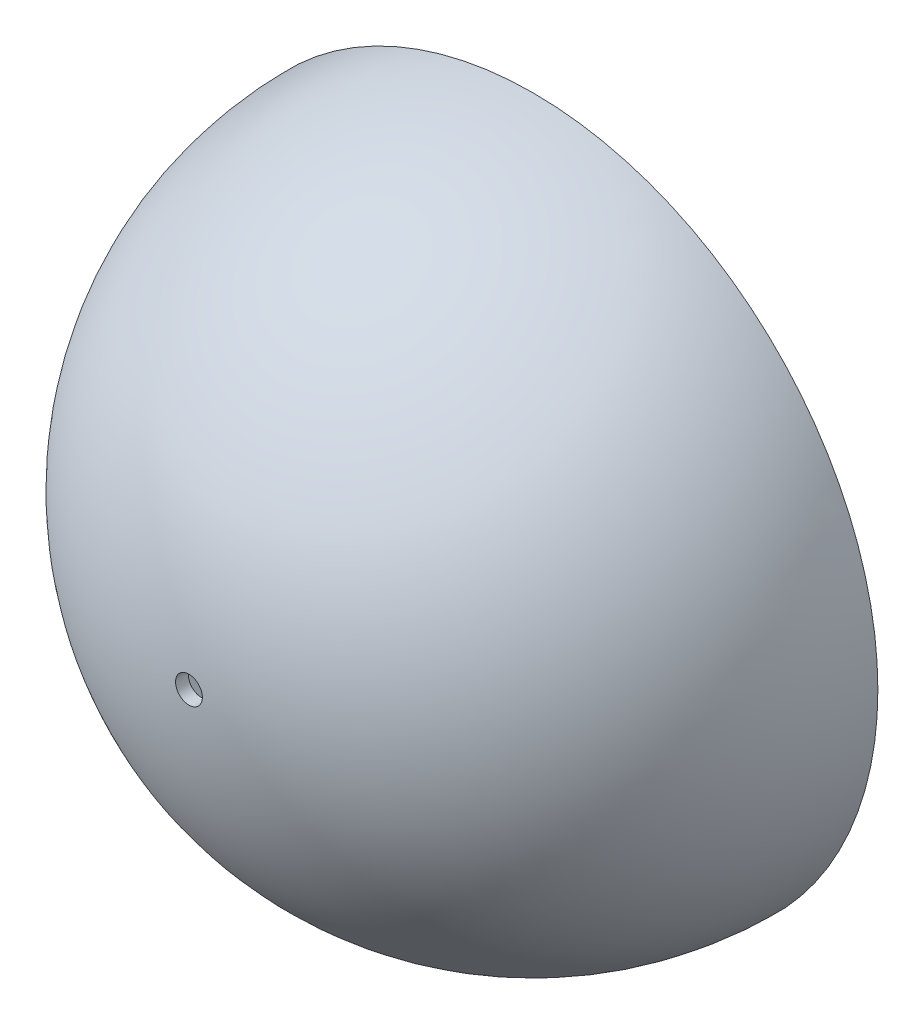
ISO-10303-21;
HEADER;
FILE_DESCRIPTION(('STEP AP214'),'2;1');
FILE_NAME('part.step','',(''),(''),'','','');
FILE_SCHEMA(('AUTOMOTIVE_DESIGN { 1 0 10303 214 1 1 1 1 }'));
ENDSEC;
DATA;
#1=APPLICATION_CONTEXT('core data for automotive mechanical design processes');
#2=APPLICATION_PROTOCOL_DEFINITION('international standard','automotive_design',2000,#1);
#3=PRODUCT_CONTEXT('',#1,'mechanical');
#4=PRODUCT('Part','Part','',(#3));
#5=PRODUCT_RELATED_PRODUCT_CATEGORY('part','',(#4));
#6=PRODUCT_DEFINITION_FORMATION('','',#4);
#7=PRODUCT_DEFINITION_CONTEXT('part definition',#1,'design');
#8=PRODUCT_DEFINITION('design','',#6,#7);
#9=PRODUCT_DEFINITION_SHAPE('','',#8);
#10=(LENGTH_UNIT() NAMED_UNIT(*) SI_UNIT(.MILLI.,.METRE.));
#11=(NAMED_UNIT(*) PLANE_ANGLE_UNIT() SI_UNIT($,.RADIAN.));
#12=(NAMED_UNIT(*) SI_UNIT($,.STERADIAN.) SOLID_ANGLE_UNIT());
#13=UNCERTAINTY_MEASURE_WITH_UNIT(LENGTH_MEASURE(1.E-05),#10,'distance_accuracy_value','');
#14=(GEOMETRIC_REPRESENTATION_CONTEXT(3) GLOBAL_UNCERTAINTY_ASSIGNED_CONTEXT((#13)) GLOBAL_UNIT_ASSIGNED_CONTEXT((#10,
#11,#12)) REPRESENTATION_CONTEXT('',''));
#15=CARTESIAN_POINT('',(0.,0.,0.));
#16=DIRECTION('',(0.,0.,1.));
#17=DIRECTION('',(1.,0.,0.));
#18=AXIS2_PLACEMENT_3D('',#15,#16,#17);
#19=CARTESIAN_POINT('',(0.,0.,0.));
#20=DIRECTION('',(0.,0.,1.));
#21=DIRECTION('',(-1.,0.,0.));
#22=AXIS2_PLACEMENT_3D('',#19,#20,#21);
#23=PLANE('',#22);
#24=CARTESIAN_POINT('',(0.,0.,0.));
#25=DIRECTION('',(0.,0.,-1.));
#26=DIRECTION('',(-1.,0.,0.));
#27=AXIS2_PLACEMENT_3D('',#24,#25,#26);
#28=CIRCLE('',#27,54.);
#29=CARTESIAN_POINT('',(-54.,0.,0.));
#30=VERTEX_POINT('',#29);
#31=EDGE_CURVE('E10',#30,#30,#28,.T.);
#32=ORIENTED_EDGE('',*,*,#31,.T.);
#33=EDGE_LOOP('',(#32));
#34=FACE_BOUND('',#33,.T.);
#35=CARTESIAN_POINT('',(0.,0.,0.));
#36=DIRECTION('',(0.,0.,1.));
#37=DIRECTION('',(0.,-1.,0.));
#38=AXIS2_PLACEMENT_3D('',#35,#36,#37);
#39=CIRCLE('',#38,52.);
#40=CARTESIAN_POINT('',(0.,-52.,-3.63114269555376E-13));
#41=VERTEX_POINT('',#40);
#42=EDGE_CURVE('E38',#41,#41,#39,.F.);
#43=ORIENTED_EDGE('',*,*,#42,.F.);
#44=EDGE_LOOP('',(#43));
#45=FACE_BOUND('',#44,.T.);
#46=ADVANCED_FACE('F30',(#34,#45),#23,.F.);
#47=CARTESIAN_POINT('',(0.,0.,0.));
#48=DIRECTION('',(-1.,0.,0.));
#49=DIRECTION('',(0.,-1.,0.));
#50=AXIS2_PLACEMENT_3D('',#47,#48,#49);
#51=SPHERICAL_SURFACE('',#50,54.);
#52=CARTESIAN_POINT('',(0.,0.,0.));
#53=DIRECTION('',(0.,0.,-1.));
#54=DIRECTION('',(0.,1.,0.));
#55=AXIS2_PLACEMENT_3D('',#52,#53,#54);
#56=SPHERICAL_SURFACE('',#55,54.);
#57=CARTESIAN_POINT('',(0.,-3.76794957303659E-13,53.9591512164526));
#58=DIRECTION('',(0.,0.,-1.));
#59=DIRECTION('',(0.,1.,0.));
#60=AXIS2_PLACEMENT_3D('',#57,#58,#59);
#61=CIRCLE('',#60,2.1);
#62=CARTESIAN_POINT('',(0.,2.09999999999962,53.9591512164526));
#63=VERTEX_POINT('',#62);
#64=EDGE_CURVE('E42',#63,#63,#61,.T.);
#65=ORIENTED_EDGE('',*,*,#64,.T.);
#66=EDGE_LOOP('',(#65));
#67=FACE_BOUND('',#66,.T.);
#68=ORIENTED_EDGE('',*,*,#31,.F.);
#69=EDGE_LOOP('',(#68));
#70=FACE_BOUND('',#69,.T.);
#71=ADVANCED_FACE('F32',(#67,#70),#56,.T.);
#72=CARTESIAN_POINT('',(0.,0.,0.));
#73=DIRECTION('',(-1.,0.,0.));
#74=DIRECTION('',(0.,-1.,0.));
#75=AXIS2_PLACEMENT_3D('',#72,#73,#74);
#76=SPHERICAL_SURFACE('',#75,52.);
#77=CARTESIAN_POINT('',(0.,0.,0.));
#78=DIRECTION('',(0.,0.,-1.));
#79=DIRECTION('',(0.,1.,0.));
#80=AXIS2_PLACEMENT_3D('',#77,#78,#79);
#81=SPHERICAL_SURFACE('',#80,52.);
#82=CARTESIAN_POINT('',(0.,-3.62818044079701E-13,51.957578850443));
#83=DIRECTION('',(0.,0.,-1.));
#84=DIRECTION('',(0.,1.,0.));
#85=AXIS2_PLACEMENT_3D('',#82,#83,#84);
#86=CIRCLE('',#85,2.1);
#87=CARTESIAN_POINT('',(0.,2.09999999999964,51.957578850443));
#88=VERTEX_POINT('',#87);
#89=EDGE_CURVE('E34',#88,#88,#86,.T.);
#90=ORIENTED_EDGE('',*,*,#89,.F.);
#91=EDGE_LOOP('',(#90));
#92=FACE_BOUND('',#91,.T.);
#93=ORIENTED_EDGE('',*,*,#42,.T.);
#94=EDGE_LOOP('',(#93));
#95=FACE_BOUND('',#94,.T.);
#96=ADVANCED_FACE('F54',(#92,#95),#81,.F.);
#97=CARTESIAN_POINT('',(0.,-3.77080202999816E-13,54.0000000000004));
#98=DIRECTION('',(0.,0.,-1.));
#99=DIRECTION('',(0.,1.,0.));
#100=AXIS2_PLACEMENT_3D('',#97,#98,#99);
#101=CYLINDRICAL_SURFACE('',#100,2.1);
#102=ORIENTED_EDGE('',*,*,#89,.T.);
#103=EDGE_LOOP('',(#102));
#104=FACE_BOUND('',#103,.T.);
#105=ORIENTED_EDGE('',*,*,#64,.F.);
#106=EDGE_LOOP('',(#105));
#107=FACE_BOUND('',#106,.T.);
#108=ADVANCED_FACE('F51',(#104,#107),#101,.F.);
#109=CLOSED_SHELL('',(#46,#71,#96,#108));
#110=MANIFOLD_SOLID_BREP('B2',#109);
#111=ADVANCED_BREP_SHAPE_REPRESENTATION('',(#18,#110),#14);
#112=SHAPE_DEFINITION_REPRESENTATION(#9,#111);
ENDSEC;
END-ISO-10303-21;
